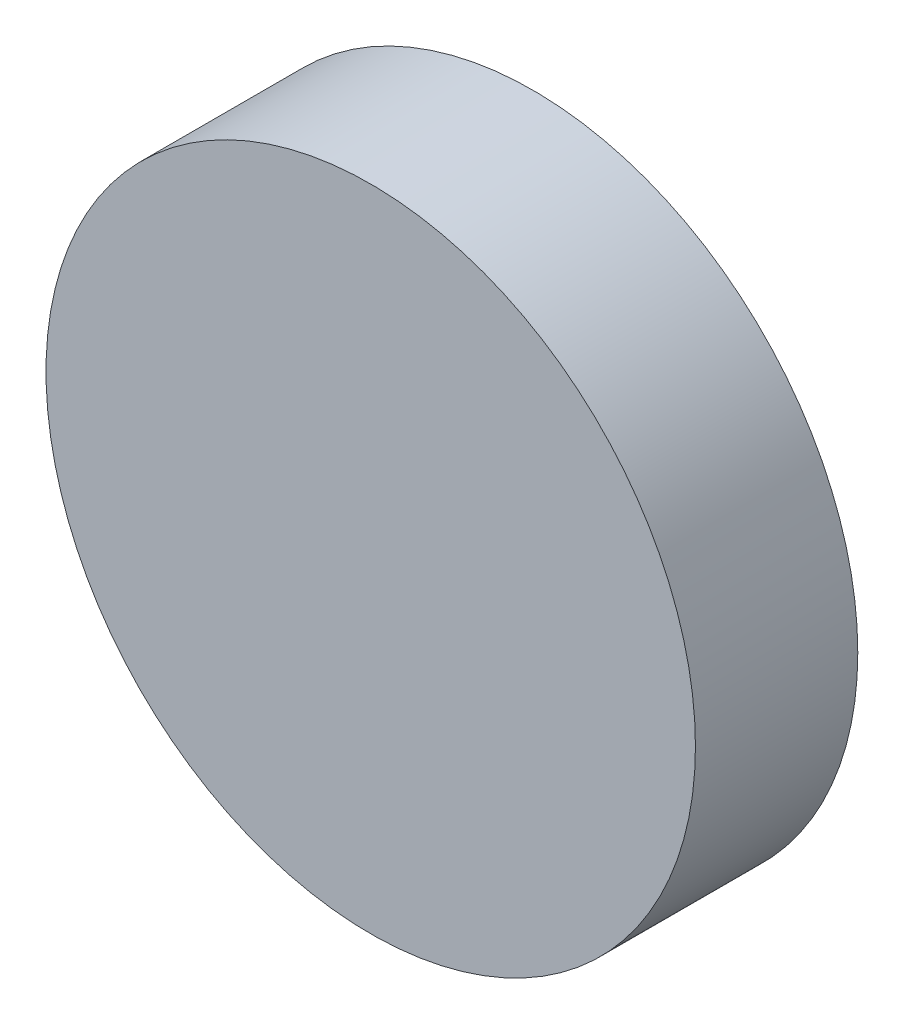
ISO-10303-21;
HEADER;
FILE_DESCRIPTION(('STEP AP214'),'2;1');
FILE_NAME('part.step','',(''),(''),'','','');
FILE_SCHEMA(('AUTOMOTIVE_DESIGN { 1 0 10303 214 1 1 1 1 }'));
ENDSEC;
DATA;
#1=APPLICATION_CONTEXT('core data for automotive mechanical design processes');
#2=APPLICATION_PROTOCOL_DEFINITION('international standard','automotive_design',2000,#1);
#3=PRODUCT_CONTEXT('',#1,'mechanical');
#4=PRODUCT('Part','Part','',(#3));
#5=PRODUCT_RELATED_PRODUCT_CATEGORY('part','',(#4));
#6=PRODUCT_DEFINITION_FORMATION('','',#4);
#7=PRODUCT_DEFINITION_CONTEXT('part definition',#1,'design');
#8=PRODUCT_DEFINITION('design','',#6,#7);
#9=PRODUCT_DEFINITION_SHAPE('','',#8);
#10=(LENGTH_UNIT() NAMED_UNIT(*) SI_UNIT(.MILLI.,.METRE.));
#11=(NAMED_UNIT(*) PLANE_ANGLE_UNIT() SI_UNIT($,.RADIAN.));
#12=(NAMED_UNIT(*) SI_UNIT($,.STERADIAN.) SOLID_ANGLE_UNIT());
#13=UNCERTAINTY_MEASURE_WITH_UNIT(LENGTH_MEASURE(1.E-05),#10,'distance_accuracy_value','');
#14=(GEOMETRIC_REPRESENTATION_CONTEXT(3) GLOBAL_UNCERTAINTY_ASSIGNED_CONTEXT((#13)) GLOBAL_UNIT_ASSIGNED_CONTEXT((#10,
#11,#12)) REPRESENTATION_CONTEXT('',''));
#15=CARTESIAN_POINT('',(0.,0.,0.));
#16=DIRECTION('',(0.,0.,1.));
#17=DIRECTION('',(1.,0.,0.));
#18=AXIS2_PLACEMENT_3D('',#15,#16,#17);
#19=CARTESIAN_POINT('',(0.,0.,12.5));
#20=DIRECTION('',(0.,0.,-1.));
#21=DIRECTION('',(-1.,0.,0.));
#22=AXIS2_PLACEMENT_3D('',#19,#20,#21);
#23=CYLINDRICAL_SURFACE('',#22,25.);
#24=CARTESIAN_POINT('',(0.,0.,12.5));
#25=DIRECTION('',(0.,0.,1.));
#26=DIRECTION('',(1.,0.,0.));
#27=AXIS2_PLACEMENT_3D('',#24,#25,#26);
#28=CIRCLE('',#27,25.);
#29=CARTESIAN_POINT('',(25.,0.,12.5));
#30=VERTEX_POINT('',#29);
#31=EDGE_CURVE('E10',#30,#30,#28,.T.);
#32=ORIENTED_EDGE('',*,*,#31,.F.);
#33=EDGE_LOOP('',(#32));
#34=FACE_BOUND('',#33,.T.);
#35=CARTESIAN_POINT('',(0.,0.,0.));
#36=DIRECTION('',(0.,0.,1.));
#37=DIRECTION('',(1.,0.,0.));
#38=AXIS2_PLACEMENT_3D('',#35,#36,#37);
#39=CIRCLE('',#38,25.);
#40=CARTESIAN_POINT('',(25.,0.,0.));
#41=VERTEX_POINT('',#40);
#42=EDGE_CURVE('E40',#41,#41,#39,.T.);
#43=ORIENTED_EDGE('',*,*,#42,.T.);
#44=EDGE_LOOP('',(#43));
#45=FACE_BOUND('',#44,.T.);
#46=ADVANCED_FACE('F37',(#34,#45),#23,.T.);
#47=CARTESIAN_POINT('',(0.,0.,12.5));
#48=DIRECTION('',(0.,0.,1.));
#49=DIRECTION('',(1.,0.,0.));
#50=AXIS2_PLACEMENT_3D('',#47,#48,#49);
#51=PLANE('',#50);
#52=ORIENTED_EDGE('',*,*,#31,.T.);
#53=EDGE_LOOP('',(#52));
#54=FACE_BOUND('',#53,.T.);
#55=ADVANCED_FACE('F52',(#54),#51,.T.);
#56=CARTESIAN_POINT('',(0.,0.,0.));
#57=DIRECTION('',(0.,0.,1.));
#58=DIRECTION('',(1.,0.,0.));
#59=AXIS2_PLACEMENT_3D('',#56,#57,#58);
#60=PLANE('',#59);
#61=ORIENTED_EDGE('',*,*,#42,.F.);
#62=EDGE_LOOP('',(#61));
#63=FACE_BOUND('',#62,.T.);
#64=ADVANCED_FACE('F50',(#63),#60,.F.);
#65=CLOSED_SHELL('',(#46,#55,#64));
#66=MANIFOLD_SOLID_BREP('B2',#65);
#67=ADVANCED_BREP_SHAPE_REPRESENTATION('',(#18,#66),#14);
#68=SHAPE_DEFINITION_REPRESENTATION(#9,#67);
ENDSEC;
END-ISO-10303-21;
